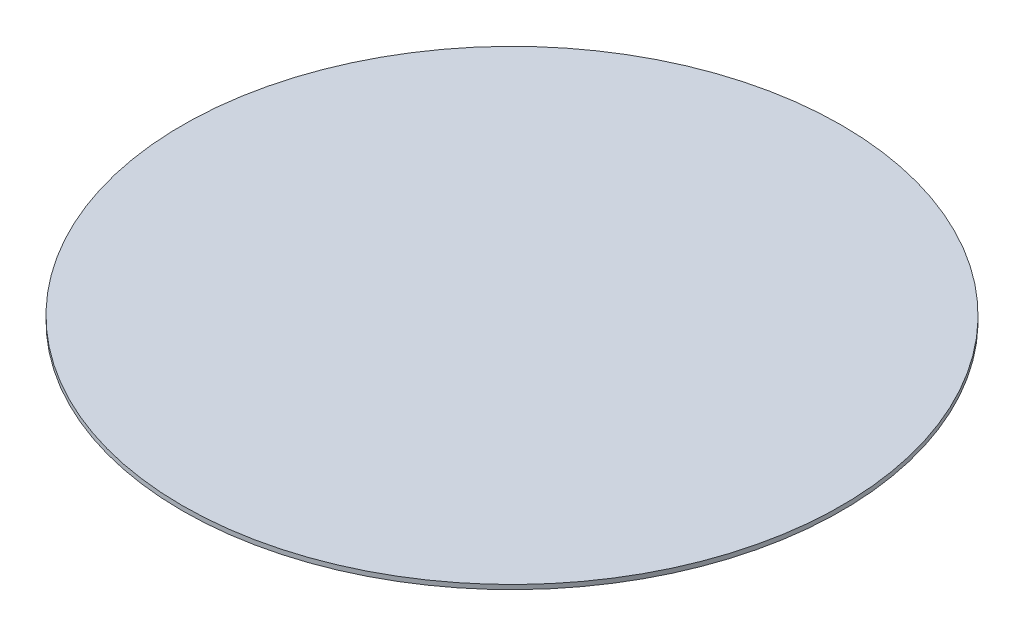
from build123d import *

# Parameters (mm, degrees)
CROQUIS4_R              = 147
SALIENTE_EXTRUIR1_DEPTH = 2


with BuildPart() as part:
    # Croquis4 → Saliente-Extruir1 (new body)
    with BuildSketch(Plane(origin=(0, 0, 0), x_dir=(1, 0, 0), z_dir=(0, 1, 0))):
        with Locations(Location((0, 0, 0), (0, 0, 270))):
            Circle(CROQUIS4_R)
    extrude(amount=SALIENTE_EXTRUIR1_DEPTH)


solid = part.part
